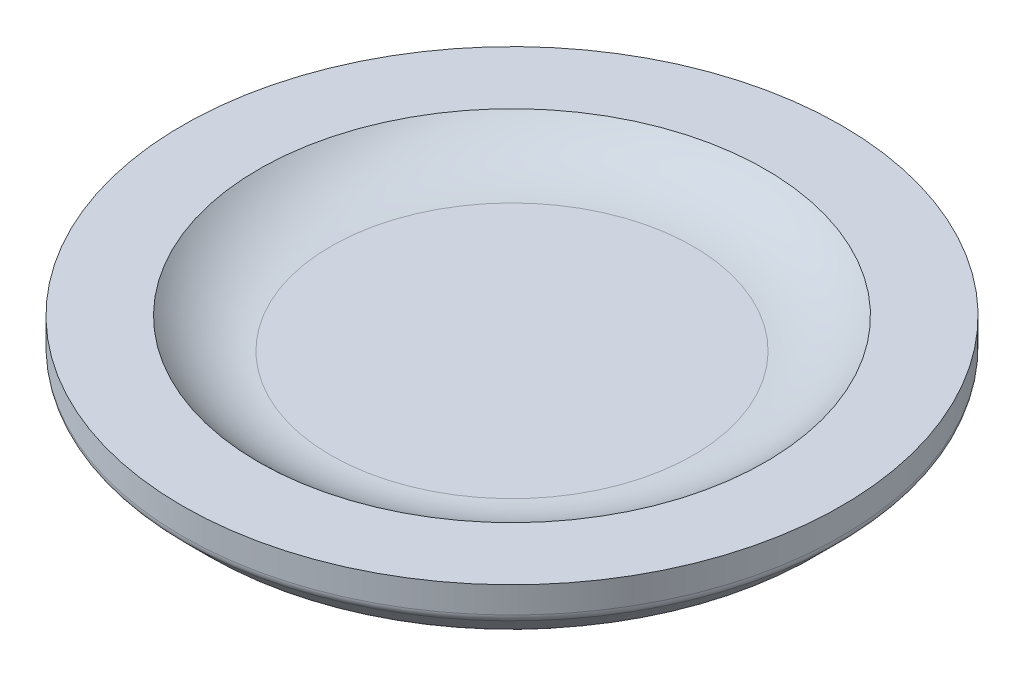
ISO-10303-21;
HEADER;
FILE_DESCRIPTION(('STEP AP214'),'2;1');
FILE_NAME('part.step','',(''),(''),'','','');
FILE_SCHEMA(('AUTOMOTIVE_DESIGN { 1 0 10303 214 1 1 1 1 }'));
ENDSEC;
DATA;
#1=APPLICATION_CONTEXT('core data for automotive mechanical design processes');
#2=APPLICATION_PROTOCOL_DEFINITION('international standard','automotive_design',2000,#1);
#3=PRODUCT_CONTEXT('',#1,'mechanical');
#4=PRODUCT('Part','Part','',(#3));
#5=PRODUCT_RELATED_PRODUCT_CATEGORY('part','',(#4));
#6=PRODUCT_DEFINITION_FORMATION('','',#4);
#7=PRODUCT_DEFINITION_CONTEXT('part definition',#1,'design');
#8=PRODUCT_DEFINITION('design','',#6,#7);
#9=PRODUCT_DEFINITION_SHAPE('','',#8);
#10=(LENGTH_UNIT() NAMED_UNIT(*) SI_UNIT(.MILLI.,.METRE.));
#11=(NAMED_UNIT(*) PLANE_ANGLE_UNIT() SI_UNIT($,.RADIAN.));
#12=(NAMED_UNIT(*) SI_UNIT($,.STERADIAN.) SOLID_ANGLE_UNIT());
#13=UNCERTAINTY_MEASURE_WITH_UNIT(LENGTH_MEASURE(1.E-05),#10,'distance_accuracy_value','');
#14=(GEOMETRIC_REPRESENTATION_CONTEXT(3) GLOBAL_UNCERTAINTY_ASSIGNED_CONTEXT((#13)) GLOBAL_UNIT_ASSIGNED_CONTEXT((#10,
#11,#12)) REPRESENTATION_CONTEXT('',''));
#15=CARTESIAN_POINT('',(0.,0.,0.));
#16=DIRECTION('',(0.,0.,1.));
#17=DIRECTION('',(1.,0.,0.));
#18=AXIS2_PLACEMENT_3D('',#15,#16,#17);
#19=CARTESIAN_POINT('',(0.,6.,0.));
#20=DIRECTION('',(0.,-1.,0.));
#21=DIRECTION('',(0.,0.,-1.));
#22=AXIS2_PLACEMENT_3D('',#19,#20,#21);
#23=CYLINDRICAL_SURFACE('',#22,32.5);
#24=CARTESIAN_POINT('',(0.,3.41421356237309,0.));
#25=DIRECTION('',(0.,-1.,0.));
#26=DIRECTION('',(0.,0.,-1.));
#27=AXIS2_PLACEMENT_3D('',#24,#25,#26);
#28=CIRCLE('',#27,32.5);
#29=CARTESIAN_POINT('',(0.,3.41421356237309,-32.5));
#30=VERTEX_POINT('',#29);
#31=EDGE_CURVE('E57',#30,#30,#28,.F.);
#32=ORIENTED_EDGE('',*,*,#31,.T.);
#33=EDGE_LOOP('',(#32));
#34=FACE_BOUND('',#33,.T.);
#35=CARTESIAN_POINT('',(0.,6.,0.));
#36=DIRECTION('',(0.,1.,0.));
#37=DIRECTION('',(0.,0.,1.));
#38=AXIS2_PLACEMENT_3D('',#35,#36,#37);
#39=CIRCLE('',#38,32.5);
#40=CARTESIAN_POINT('',(0.,6.,32.5));
#41=VERTEX_POINT('',#40);
#42=EDGE_CURVE('E67',#41,#41,#39,.T.);
#43=ORIENTED_EDGE('',*,*,#42,.F.);
#44=EDGE_LOOP('',(#43));
#45=FACE_BOUND('',#44,.T.);
#46=ADVANCED_FACE('F39',(#34,#45),#23,.T.);
#47=CARTESIAN_POINT('',(0.,6.,0.));
#48=DIRECTION('',(0.,1.,0.));
#49=DIRECTION('',(0.,0.,1.));
#50=AXIS2_PLACEMENT_3D('',#47,#48,#49);
#51=PLANE('',#50);
#52=CARTESIAN_POINT('',(0.,6.,0.));
#53=DIRECTION('',(0.,1.,0.));
#54=DIRECTION('',(0.,0.,1.));
#55=AXIS2_PLACEMENT_3D('',#52,#53,#54);
#56=CIRCLE('',#55,25.);
#57=CARTESIAN_POINT('',(0.,6.,25.));
#58=VERTEX_POINT('',#57);
#59=EDGE_CURVE('E71',#58,#58,#56,.T.);
#60=ORIENTED_EDGE('',*,*,#59,.F.);
#61=EDGE_LOOP('',(#60));
#62=FACE_BOUND('',#61,.T.);
#63=ORIENTED_EDGE('',*,*,#42,.T.);
#64=EDGE_LOOP('',(#63));
#65=FACE_BOUND('',#64,.T.);
#66=ADVANCED_FACE('F79',(#62,#65),#51,.T.);
#67=CARTESIAN_POINT('',(0.,0.,0.));
#68=DIRECTION('',(0.,1.,0.));
#69=DIRECTION('',(0.,0.,1.));
#70=AXIS2_PLACEMENT_3D('',#67,#68,#69);
#71=PLANE('',#70);
#72=CARTESIAN_POINT('',(0.,0.,0.));
#73=DIRECTION('',(0.,1.,0.));
#74=DIRECTION('',(0.,0.,1.));
#75=AXIS2_PLACEMENT_3D('',#72,#73,#74);
#76=CIRCLE('',#75,29.0857864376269);
#77=CARTESIAN_POINT('',(0.,0.,29.0857864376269));
#78=VERTEX_POINT('',#77);
#79=EDGE_CURVE('E10',#78,#78,#76,.F.);
#80=ORIENTED_EDGE('',*,*,#79,.T.);
#81=EDGE_LOOP('',(#80));
#82=FACE_BOUND('',#81,.T.);
#83=ADVANCED_FACE('F82',(#82),#71,.F.);
#84=CARTESIAN_POINT('',(0.,3.,0.));
#85=DIRECTION('',(0.,1.,0.));
#86=DIRECTION('',(0.,0.,1.));
#87=AXIS2_PLACEMENT_3D('',#84,#85,#86);
#88=PLANE('',#87);
#89=CARTESIAN_POINT('',(0.,3.,0.));
#90=DIRECTION('',(0.,1.,0.));
#91=DIRECTION('',(0.,0.,1.));
#92=AXIS2_PLACEMENT_3D('',#89,#90,#91);
#93=CIRCLE('',#92,17.8585715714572);
#94=CARTESIAN_POINT('',(0.,3.,17.8585715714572));
#95=VERTEX_POINT('',#94);
#96=EDGE_CURVE('E63',#95,#95,#93,.T.);
#97=ORIENTED_EDGE('',*,*,#96,.T.);
#98=EDGE_LOOP('',(#97));
#99=FACE_BOUND('',#98,.T.);
#100=ADVANCED_FACE('F96',(#99),#88,.T.);
#101=CARTESIAN_POINT('',(0.,13.,0.));
#102=DIRECTION('',(0.,-1.,0.));
#103=DIRECTION('',(0.,0.,-1.));
#104=AXIS2_PLACEMENT_3D('',#101,#102,#103);
#105=TOROIDAL_SURFACE('',#104,17.8585715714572,10.);
#106=ORIENTED_EDGE('',*,*,#59,.T.);
#107=EDGE_LOOP('',(#106));
#108=FACE_BOUND('',#107,.T.);
#109=ORIENTED_EDGE('',*,*,#96,.F.);
#110=EDGE_LOOP('',(#109));
#111=FACE_BOUND('',#110,.T.);
#112=ADVANCED_FACE('F76',(#108,#111),#105,.F.);
#113=CARTESIAN_POINT('',(0.,3.,0.));
#114=DIRECTION('',(0.,1.,0.));
#115=DIRECTION('',(0.,0.,1.));
#116=AXIS2_PLACEMENT_3D('',#113,#114,#115);
#117=CONICAL_SURFACE('',#116,32.5,0.78539816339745);
#118=CARTESIAN_POINT('',(0.,2.70710678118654,0.));
#119=DIRECTION('',(0.,1.,0.));
#120=DIRECTION('',(0.,0.,1.));
#121=AXIS2_PLACEMENT_3D('',#118,#119,#120);
#122=CIRCLE('',#121,32.2071067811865);
#123=CARTESIAN_POINT('',(0.,2.70710678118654,32.2071067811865));
#124=VERTEX_POINT('',#123);
#125=EDGE_CURVE('E47',#124,#124,#122,.F.);
#126=ORIENTED_EDGE('',*,*,#125,.T.);
#127=EDGE_LOOP('',(#126));
#128=FACE_BOUND('',#127,.T.);
#129=CARTESIAN_POINT('',(0.,0.292893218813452,0.));
#130=DIRECTION('',(0.,1.,0.));
#131=DIRECTION('',(0.,0.,1.));
#132=AXIS2_PLACEMENT_3D('',#129,#130,#131);
#133=CIRCLE('',#132,29.7928932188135);
#134=CARTESIAN_POINT('',(0.,0.292893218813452,29.7928932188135));
#135=VERTEX_POINT('',#134);
#136=EDGE_CURVE('E52',#135,#135,#133,.T.);
#137=ORIENTED_EDGE('',*,*,#136,.T.);
#138=EDGE_LOOP('',(#137));
#139=FACE_BOUND('',#138,.T.);
#140=ADVANCED_FACE('F95',(#128,#139),#117,.T.);
#141=CARTESIAN_POINT('',(0.,3.41421356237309,0.));
#142=DIRECTION('',(0.,-1.,0.));
#143=DIRECTION('',(0.,0.,-1.));
#144=AXIS2_PLACEMENT_3D('',#141,#142,#143);
#145=TOROIDAL_SURFACE('',#144,31.5,1.);
#146=ORIENTED_EDGE('',*,*,#125,.F.);
#147=EDGE_LOOP('',(#146));
#148=FACE_BOUND('',#147,.T.);
#149=ORIENTED_EDGE('',*,*,#31,.F.);
#150=EDGE_LOOP('',(#149));
#151=FACE_BOUND('',#150,.T.);
#152=ADVANCED_FACE('F101',(#148,#151),#145,.T.);
#153=CARTESIAN_POINT('',(0.,1.,0.));
#154=DIRECTION('',(0.,1.,0.));
#155=DIRECTION('',(0.,0.,1.));
#156=AXIS2_PLACEMENT_3D('',#153,#154,#155);
#157=TOROIDAL_SURFACE('',#156,29.0857864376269,1.);
#158=ORIENTED_EDGE('',*,*,#136,.F.);
#159=EDGE_LOOP('',(#158));
#160=FACE_BOUND('',#159,.T.);
#161=ORIENTED_EDGE('',*,*,#79,.F.);
#162=EDGE_LOOP('',(#161));
#163=FACE_BOUND('',#162,.T.);
#164=ADVANCED_FACE('F41',(#160,#163),#157,.T.);
#165=CLOSED_SHELL('',(#46,#66,#83,#100,#112,#140,#152,#164));
#166=MANIFOLD_SOLID_BREP('B2',#165);
#167=ADVANCED_BREP_SHAPE_REPRESENTATION('',(#18,#166),#14);
#168=SHAPE_DEFINITION_REPRESENTATION(#9,#167);
ENDSEC;
END-ISO-10303-21;
